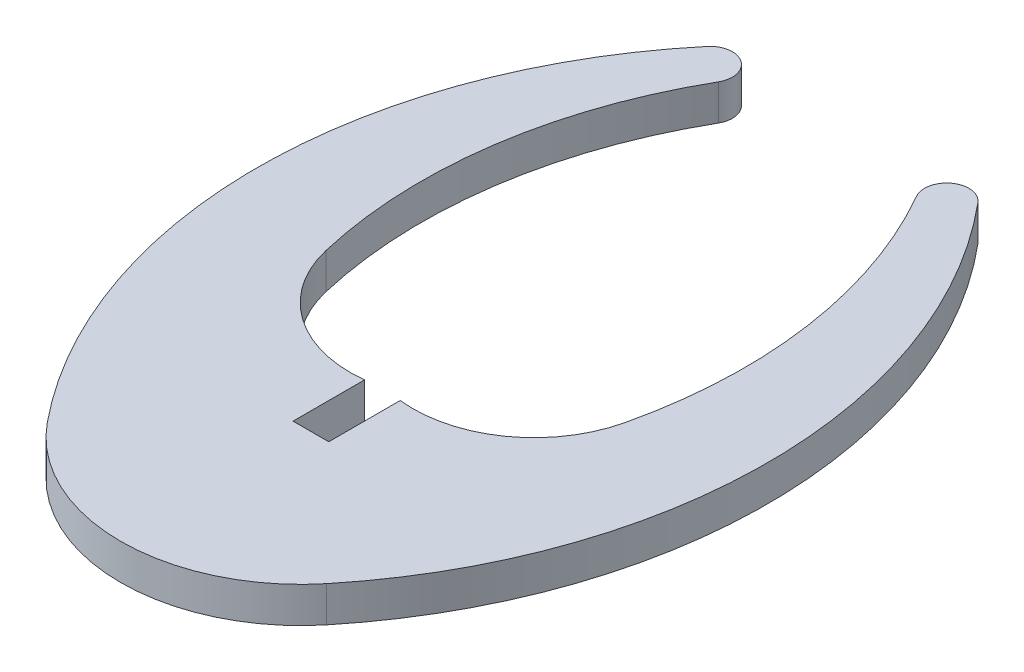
ISO-10303-21;
HEADER;
FILE_DESCRIPTION(('STEP AP214'),'2;1');
FILE_NAME('part.step','',(''),(''),'','','');
FILE_SCHEMA(('AUTOMOTIVE_DESIGN { 1 0 10303 214 1 1 1 1 }'));
ENDSEC;
DATA;
#1=APPLICATION_CONTEXT('core data for automotive mechanical design processes');
#2=APPLICATION_PROTOCOL_DEFINITION('international standard','automotive_design',2000,#1);
#3=PRODUCT_CONTEXT('',#1,'mechanical');
#4=PRODUCT('Part','Part','',(#3));
#5=PRODUCT_RELATED_PRODUCT_CATEGORY('part','',(#4));
#6=PRODUCT_DEFINITION_FORMATION('','',#4);
#7=PRODUCT_DEFINITION_CONTEXT('part definition',#1,'design');
#8=PRODUCT_DEFINITION('design','',#6,#7);
#9=PRODUCT_DEFINITION_SHAPE('','',#8);
#10=(LENGTH_UNIT() NAMED_UNIT(*) SI_UNIT(.MILLI.,.METRE.));
#11=(NAMED_UNIT(*) PLANE_ANGLE_UNIT() SI_UNIT($,.RADIAN.));
#12=(NAMED_UNIT(*) SI_UNIT($,.STERADIAN.) SOLID_ANGLE_UNIT());
#13=UNCERTAINTY_MEASURE_WITH_UNIT(LENGTH_MEASURE(1.E-05),#10,'distance_accuracy_value','');
#14=(GEOMETRIC_REPRESENTATION_CONTEXT(3) GLOBAL_UNCERTAINTY_ASSIGNED_CONTEXT((#13)) GLOBAL_UNIT_ASSIGNED_CONTEXT((#10,
#11,#12)) REPRESENTATION_CONTEXT('',''));
#15=CARTESIAN_POINT('',(0.,0.,0.));
#16=DIRECTION('',(0.,0.,1.));
#17=DIRECTION('',(1.,0.,0.));
#18=AXIS2_PLACEMENT_3D('',#15,#16,#17);
#19=CARTESIAN_POINT('',(-41982.755885,3.,-18425.403028));
#20=DIRECTION('',(-0.999999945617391,0.,0.000329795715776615));
#21=DIRECTION('',(0.000329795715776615,0.,0.999999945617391));
#22=AXIS2_PLACEMENT_3D('',#19,#20,#21);
#23=PLANE('',#22);
#24=DIRECTION('',(-0.000329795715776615,0.,-0.999999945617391));
#25=VECTOR('',#24,1.);
#26=CARTESIAN_POINT('',(-41982.755885,0.,-18425.403028));
#27=LINE('',#26,#25);
#28=CARTESIAN_POINT('',(-41982.753906,0.,-18419.402344));
#29=VERTEX_POINT('',#28);
#30=CARTESIAN_POINT('',(-41982.755885,0.,-18425.403028));
#31=VERTEX_POINT('',#30);
#32=EDGE_CURVE('E156',#29,#31,#27,.T.);
#33=ORIENTED_EDGE('',*,*,#32,.T.);
#34=DIRECTION('',(0.,-1.,0.));
#35=VECTOR('',#34,1.);
#36=CARTESIAN_POINT('',(-41982.755885,3.,-18425.403028));
#37=LINE('',#36,#35);
#38=CARTESIAN_POINT('',(-41982.755885,3.,-18425.403028));
#39=VERTEX_POINT('',#38);
#40=EDGE_CURVE('E11',#39,#31,#37,.T.);
#41=ORIENTED_EDGE('',*,*,#40,.F.);
#42=DIRECTION('',(-0.000329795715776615,0.,-0.999999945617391));
#43=VECTOR('',#42,1.);
#44=CARTESIAN_POINT('',(-41982.755885,3.,-18425.403028));
#45=LINE('',#44,#43);
#46=CARTESIAN_POINT('',(-41982.753906,3.,-18419.402344));
#47=VERTEX_POINT('',#46);
#48=EDGE_CURVE('E178',#47,#39,#45,.T.);
#49=ORIENTED_EDGE('',*,*,#48,.F.);
#50=DIRECTION('',(0.,-1.,0.));
#51=VECTOR('',#50,1.);
#52=CARTESIAN_POINT('',(-41982.753906,3.,-18419.402344));
#53=LINE('',#52,#51);
#54=EDGE_CURVE('E152',#47,#29,#53,.T.);
#55=ORIENTED_EDGE('',*,*,#54,.T.);
#56=EDGE_LOOP('',(#33,#41,#49,#55));
#57=FACE_BOUND('',#56,.T.);
#58=ADVANCED_FACE('F36',(#57),#23,.F.);
#59=CARTESIAN_POINT('',(-41983.8853105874,3.,-18435.5029115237));
#60=DIRECTION('',(0.,-1.,0.));
#61=DIRECTION('',(0.,0.,-1.));
#62=AXIS2_PLACEMENT_3D('',#59,#60,#61);
#63=CYLINDRICAL_SURFACE('',#62,10.1628366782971);
#64=CARTESIAN_POINT('',(-41983.8853105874,0.,-18435.5029115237));
#65=DIRECTION('',(0.,-1.,0.));
#66=DIRECTION('',(0.,0.,1.));
#67=AXIS2_PLACEMENT_3D('',#64,#65,#66);
#68=CIRCLE('',#67,10.1628366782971);
#69=CARTESIAN_POINT('',(-41993.780939,0.,-18433.18779));
#70=VERTEX_POINT('',#69);
#71=EDGE_CURVE('E159',#31,#70,#68,.T.);
#72=ORIENTED_EDGE('',*,*,#71,.T.);
#73=DIRECTION('',(0.,-1.,0.));
#74=VECTOR('',#73,1.);
#75=CARTESIAN_POINT('',(-41993.780939,3.,-18433.18779));
#76=LINE('',#75,#74);
#77=CARTESIAN_POINT('',(-41993.780939,3.,-18433.18779));
#78=VERTEX_POINT('',#77);
#79=EDGE_CURVE('E44',#78,#70,#76,.T.);
#80=ORIENTED_EDGE('',*,*,#79,.F.);
#81=CARTESIAN_POINT('',(-41983.8853105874,3.,-18435.5029115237));
#82=DIRECTION('',(0.,-1.,0.));
#83=DIRECTION('',(0.,0.,1.));
#84=AXIS2_PLACEMENT_3D('',#81,#82,#83);
#85=CIRCLE('',#84,10.1628366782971);
#86=EDGE_CURVE('E107',#39,#78,#85,.T.);
#87=ORIENTED_EDGE('',*,*,#86,.F.);
#88=ORIENTED_EDGE('',*,*,#40,.T.);
#89=EDGE_LOOP('',(#72,#80,#87,#88));
#90=FACE_BOUND('',#89,.T.);
#91=ADVANCED_FACE('F256',(#90),#63,.F.);
#92=CARTESIAN_POINT('',(-41955.2299410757,3.,-18442.2204008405));
#93=DIRECTION('',(0.,-1.,0.));
#94=DIRECTION('',(0.,0.,-1.));
#95=AXIS2_PLACEMENT_3D('',#92,#93,#94);
#96=CYLINDRICAL_SURFACE('',#95,39.5950438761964);
#97=CARTESIAN_POINT('',(-41955.2299410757,0.,-18442.2204008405));
#98=DIRECTION('',(0.,-1.,0.));
#99=DIRECTION('',(0.,0.,1.));
#100=AXIS2_PLACEMENT_3D('',#97,#98,#99);
#101=CIRCLE('',#100,39.5950438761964);
#102=CARTESIAN_POINT('',(-41989.570389,0.,-18461.930833));
#103=VERTEX_POINT('',#102);
#104=EDGE_CURVE('E161',#70,#103,#101,.T.);
#105=ORIENTED_EDGE('',*,*,#104,.T.);
#106=DIRECTION('',(0.,-1.,0.));
#107=VECTOR('',#106,1.);
#108=CARTESIAN_POINT('',(-41989.570389,3.,-18461.930833));
#109=LINE('',#108,#107);
#110=CARTESIAN_POINT('',(-41989.570389,3.,-18461.930833));
#111=VERTEX_POINT('',#110);
#112=EDGE_CURVE('E197',#111,#103,#109,.T.);
#113=ORIENTED_EDGE('',*,*,#112,.F.);
#114=CARTESIAN_POINT('',(-41955.2299410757,3.,-18442.2204008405));
#115=DIRECTION('',(0.,-1.,0.));
#116=DIRECTION('',(0.,0.,1.));
#117=AXIS2_PLACEMENT_3D('',#114,#115,#116);
#118=CIRCLE('',#117,39.5950438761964);
#119=EDGE_CURVE('E205',#78,#111,#118,.T.);
#120=ORIENTED_EDGE('',*,*,#119,.F.);
#121=ORIENTED_EDGE('',*,*,#79,.T.);
#122=EDGE_LOOP('',(#105,#113,#120,#121));
#123=FACE_BOUND('',#122,.T.);
#124=ADVANCED_FACE('F203',(#123),#96,.F.);
#125=CARTESIAN_POINT('',(-41991.1827796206,3.,-18462.8549007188));
#126=DIRECTION('',(0.,-1.,0.));
#127=DIRECTION('',(0.,0.,-1.));
#128=AXIS2_PLACEMENT_3D('',#125,#126,#127);
#129=CYLINDRICAL_SURFACE('',#128,1.8584145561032);
#130=CARTESIAN_POINT('',(-41991.1827796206,0.,-18462.8549007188));
#131=DIRECTION('',(0.,1.,0.));
#132=DIRECTION('',(0.,0.,1.));
#133=AXIS2_PLACEMENT_3D('',#130,#131,#132);
#134=CIRCLE('',#133,1.8584145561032);
#135=CARTESIAN_POINT('',(-41992.6064460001,0.,-18464.049421));
#136=VERTEX_POINT('',#135);
#137=EDGE_CURVE('E163',#103,#136,#134,.T.);
#138=ORIENTED_EDGE('',*,*,#137,.T.);
#139=DIRECTION('',(0.,-1.,0.));
#140=VECTOR('',#139,1.);
#141=CARTESIAN_POINT('',(-41992.6064460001,3.,-18464.049421));
#142=LINE('',#141,#140);
#143=CARTESIAN_POINT('',(-41992.6064460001,3.,-18464.049421));
#144=VERTEX_POINT('',#143);
#145=EDGE_CURVE('E194',#144,#136,#142,.T.);
#146=ORIENTED_EDGE('',*,*,#145,.F.);
#147=CARTESIAN_POINT('',(-41991.1827796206,3.,-18462.8549007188));
#148=DIRECTION('',(0.,1.,0.));
#149=DIRECTION('',(0.,0.,1.));
#150=AXIS2_PLACEMENT_3D('',#147,#148,#149);
#151=CIRCLE('',#150,1.8584145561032);
#152=EDGE_CURVE('E223',#111,#144,#151,.T.);
#153=ORIENTED_EDGE('',*,*,#152,.F.);
#154=ORIENTED_EDGE('',*,*,#112,.T.);
#155=EDGE_LOOP('',(#138,#146,#153,#154));
#156=FACE_BOUND('',#155,.T.);
#157=ADVANCED_FACE('F214',(#156),#129,.T.);
#158=CARTESIAN_POINT('',(-41959.4843939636,3.,-18436.2941148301));
#159=DIRECTION('',(0.,-1.,0.));
#160=DIRECTION('',(0.,0.,-1.));
#161=AXIS2_PLACEMENT_3D('',#158,#159,#160);
#162=CYLINDRICAL_SURFACE('',#161,43.2137403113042);
#163=CARTESIAN_POINT('',(-41959.4843939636,0.,-18436.2941148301));
#164=DIRECTION('',(0.,1.,0.));
#165=DIRECTION('',(0.,0.,1.));
#166=AXIS2_PLACEMENT_3D('',#163,#164,#165);
#167=CIRCLE('',#166,43.2137403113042);
#168=CARTESIAN_POINT('',(-41992.984684,0.,-18408.996534));
#169=VERTEX_POINT('',#168);
#170=EDGE_CURVE('E165',#136,#169,#167,.T.);
#171=ORIENTED_EDGE('',*,*,#170,.T.);
#172=DIRECTION('',(0.,-1.,0.));
#173=VECTOR('',#172,1.);
#174=CARTESIAN_POINT('',(-41992.984684,3.,-18408.996534));
#175=LINE('',#174,#173);
#176=CARTESIAN_POINT('',(-41992.984684,3.,-18408.996534));
#177=VERTEX_POINT('',#176);
#178=EDGE_CURVE('E191',#177,#169,#175,.T.);
#179=ORIENTED_EDGE('',*,*,#178,.F.);
#180=CARTESIAN_POINT('',(-41959.4843939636,3.,-18436.2941148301));
#181=DIRECTION('',(0.,1.,0.));
#182=DIRECTION('',(0.,0.,1.));
#183=AXIS2_PLACEMENT_3D('',#180,#181,#182);
#184=CIRCLE('',#183,43.2137403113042);
#185=EDGE_CURVE('E220',#144,#177,#184,.T.);
#186=ORIENTED_EDGE('',*,*,#185,.F.);
#187=ORIENTED_EDGE('',*,*,#145,.T.);
#188=EDGE_LOOP('',(#171,#179,#186,#187));
#189=FACE_BOUND('',#188,.T.);
#190=ADVANCED_FACE('F218',(#189),#162,.T.);
#191=CARTESIAN_POINT('',(-41981.2566091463,3.,-18418.5546868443));
#192=DIRECTION('',(0.,-1.,0.));
#193=DIRECTION('',(0.,0.,-1.));
#194=AXIS2_PLACEMENT_3D('',#191,#192,#193);
#195=CYLINDRICAL_SURFACE('',#194,15.1296406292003);
#196=CARTESIAN_POINT('',(-41981.2566091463,0.,-18418.5546868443));
#197=DIRECTION('',(0.,1.,0.));
#198=DIRECTION('',(0.,0.,1.));
#199=AXIS2_PLACEMENT_3D('',#196,#197,#198);
#200=CIRCLE('',#199,15.1296406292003);
#201=CARTESIAN_POINT('',(-41969.530626,0.,-18408.993968));
#202=VERTEX_POINT('',#201);
#203=EDGE_CURVE('E167',#169,#202,#200,.T.);
#204=ORIENTED_EDGE('',*,*,#203,.T.);
#205=DIRECTION('',(0.,-1.,0.));
#206=VECTOR('',#205,1.);
#207=CARTESIAN_POINT('',(-41969.530626,3.,-18408.993968));
#208=LINE('',#207,#206);
#209=CARTESIAN_POINT('',(-41969.530626,3.,-18408.993968));
#210=VERTEX_POINT('',#209);
#211=EDGE_CURVE('E188',#210,#202,#208,.T.);
#212=ORIENTED_EDGE('',*,*,#211,.F.);
#213=CARTESIAN_POINT('',(-41981.2566091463,3.,-18418.5546868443));
#214=DIRECTION('',(0.,1.,0.));
#215=DIRECTION('',(0.,0.,1.));
#216=AXIS2_PLACEMENT_3D('',#213,#214,#215);
#217=CIRCLE('',#216,15.1296406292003);
#218=EDGE_CURVE('E222',#177,#210,#217,.T.);
#219=ORIENTED_EDGE('',*,*,#218,.F.);
#220=ORIENTED_EDGE('',*,*,#178,.T.);
#221=EDGE_LOOP('',(#204,#212,#219,#220));
#222=FACE_BOUND('',#221,.T.);
#223=ADVANCED_FACE('F269',(#222),#195,.T.);
#224=CARTESIAN_POINT('',(-42003.0195178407,3.,-18436.3007296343));
#225=DIRECTION('',(0.,-1.,0.));
#226=DIRECTION('',(0.,0.,-1.));
#227=AXIS2_PLACEMENT_3D('',#224,#225,#226);
#228=CYLINDRICAL_SURFACE('',#227,43.2107059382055);
#229=CARTESIAN_POINT('',(-42003.0195178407,0.,-18436.3007296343));
#230=DIRECTION('',(0.,1.,0.));
#231=DIRECTION('',(0.,0.,1.));
#232=AXIS2_PLACEMENT_3D('',#229,#230,#231);
#233=CIRCLE('',#232,43.2107059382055);
#234=CARTESIAN_POINT('',(-41969.8920510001,0.,-18464.044847));
#235=VERTEX_POINT('',#234);
#236=EDGE_CURVE('E169',#202,#235,#233,.T.);
#237=ORIENTED_EDGE('',*,*,#236,.T.);
#238=DIRECTION('',(0.,-1.,0.));
#239=VECTOR('',#238,1.);
#240=CARTESIAN_POINT('',(-41969.8920510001,3.,-18464.044847));
#241=LINE('',#240,#239);
#242=CARTESIAN_POINT('',(-41969.8920510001,3.,-18464.044847));
#243=VERTEX_POINT('',#242);
#244=EDGE_CURVE('E185',#243,#235,#241,.T.);
#245=ORIENTED_EDGE('',*,*,#244,.F.);
#246=CARTESIAN_POINT('',(-42003.0195178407,3.,-18436.3007296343));
#247=DIRECTION('',(0.,1.,0.));
#248=DIRECTION('',(0.,0.,1.));
#249=AXIS2_PLACEMENT_3D('',#246,#247,#248);
#250=CIRCLE('',#249,43.2107059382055);
#251=EDGE_CURVE('E225',#210,#243,#250,.T.);
#252=ORIENTED_EDGE('',*,*,#251,.F.);
#253=ORIENTED_EDGE('',*,*,#211,.T.);
#254=EDGE_LOOP('',(#237,#245,#252,#253));
#255=FACE_BOUND('',#254,.T.);
#256=ADVANCED_FACE('F272',(#255),#228,.T.);
#257=CARTESIAN_POINT('',(-41971.3161001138,3.,-18462.8498222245));
#258=DIRECTION('',(0.,-1.,0.));
#259=DIRECTION('',(0.,0.,-1.));
#260=AXIS2_PLACEMENT_3D('',#257,#258,#259);
#261=CYLINDRICAL_SURFACE('',#260,1.85903203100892);
#262=CARTESIAN_POINT('',(-41971.3161001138,0.,-18462.8498222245));
#263=DIRECTION('',(0.,1.,0.));
#264=DIRECTION('',(0.,0.,1.));
#265=AXIS2_PLACEMENT_3D('',#262,#263,#264);
#266=CIRCLE('',#265,1.85903203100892);
#267=CARTESIAN_POINT('',(-41972.930009,0.,-18461.9271639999));
#268=VERTEX_POINT('',#267);
#269=EDGE_CURVE('E171',#235,#268,#266,.T.);
#270=ORIENTED_EDGE('',*,*,#269,.T.);
#271=DIRECTION('',(0.,-1.,0.));
#272=VECTOR('',#271,1.);
#273=CARTESIAN_POINT('',(-41972.930009,3.,-18461.9271639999));
#274=LINE('',#273,#272);
#275=CARTESIAN_POINT('',(-41972.930009,3.,-18461.9271639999));
#276=VERTEX_POINT('',#275);
#277=EDGE_CURVE('E182',#276,#268,#274,.T.);
#278=ORIENTED_EDGE('',*,*,#277,.F.);
#279=CARTESIAN_POINT('',(-41971.3161001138,3.,-18462.8498222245));
#280=DIRECTION('',(0.,1.,0.));
#281=DIRECTION('',(0.,0.,1.));
#282=AXIS2_PLACEMENT_3D('',#279,#280,#281);
#283=CIRCLE('',#282,1.85903203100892);
#284=EDGE_CURVE('E231',#243,#276,#283,.T.);
#285=ORIENTED_EDGE('',*,*,#284,.F.);
#286=ORIENTED_EDGE('',*,*,#244,.T.);
#287=EDGE_LOOP('',(#270,#278,#285,#286));
#288=FACE_BOUND('',#287,.T.);
#289=ADVANCED_FACE('F237',(#288),#261,.T.);
#290=CARTESIAN_POINT('',(-42007.2733840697,3.,-18442.2242472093));
#291=DIRECTION('',(0.,-1.,0.));
#292=DIRECTION('',(0.,0.,-1.));
#293=AXIS2_PLACEMENT_3D('',#290,#291,#292);
#294=CYLINDRICAL_SURFACE('',#293,39.5938422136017);
#295=CARTESIAN_POINT('',(-42007.2733840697,0.,-18442.2242472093));
#296=DIRECTION('',(0.,-1.,0.));
#297=DIRECTION('',(0.,0.,1.));
#298=AXIS2_PLACEMENT_3D('',#295,#296,#297);
#299=CIRCLE('',#298,39.5938422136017);
#300=CARTESIAN_POINT('',(-41968.725069,0.,-18433.185456));
#301=VERTEX_POINT('',#300);
#302=EDGE_CURVE('E173',#268,#301,#299,.T.);
#303=ORIENTED_EDGE('',*,*,#302,.T.);
#304=DIRECTION('',(0.,-1.,0.));
#305=VECTOR('',#304,1.);
#306=CARTESIAN_POINT('',(-41968.725069,3.,-18433.185456));
#307=LINE('',#306,#305);
#308=CARTESIAN_POINT('',(-41968.725069,3.,-18433.185456));
#309=VERTEX_POINT('',#308);
#310=EDGE_CURVE('E147',#309,#301,#307,.T.);
#311=ORIENTED_EDGE('',*,*,#310,.F.);
#312=CARTESIAN_POINT('',(-42007.2733840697,3.,-18442.2242472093));
#313=DIRECTION('',(0.,-1.,0.));
#314=DIRECTION('',(0.,0.,1.));
#315=AXIS2_PLACEMENT_3D('',#312,#313,#314);
#316=CIRCLE('',#315,39.5938422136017);
#317=EDGE_CURVE('E138',#276,#309,#316,.T.);
#318=ORIENTED_EDGE('',*,*,#317,.F.);
#319=ORIENTED_EDGE('',*,*,#277,.T.);
#320=EDGE_LOOP('',(#303,#311,#318,#319));
#321=FACE_BOUND('',#320,.T.);
#322=ADVANCED_FACE('F241',(#321),#294,.F.);
#323=CARTESIAN_POINT('',(-41978.6219159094,3.,-18435.5033261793));
#324=DIRECTION('',(0.,-1.,0.));
#325=DIRECTION('',(0.,0.,-1.));
#326=AXIS2_PLACEMENT_3D('',#323,#324,#325);
#327=CYLINDRICAL_SURFACE('',#326,10.1646495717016);
#328=CARTESIAN_POINT('',(-41978.6219159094,0.,-18435.5033261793));
#329=DIRECTION('',(0.,-1.,0.));
#330=DIRECTION('',(0.,0.,1.));
#331=AXIS2_PLACEMENT_3D('',#328,#329,#330);
#332=CIRCLE('',#331,10.1646495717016);
#333=CARTESIAN_POINT('',(-41979.757812,0.,-18425.402344));
#334=VERTEX_POINT('',#333);
#335=EDGE_CURVE('E146',#301,#334,#332,.T.);
#336=ORIENTED_EDGE('',*,*,#335,.T.);
#337=DIRECTION('',(0.,-1.,0.));
#338=VECTOR('',#337,1.);
#339=CARTESIAN_POINT('',(-41979.757812,3.,-18425.402344));
#340=LINE('',#339,#338);
#341=CARTESIAN_POINT('',(-41979.757812,3.,-18425.402344));
#342=VERTEX_POINT('',#341);
#343=EDGE_CURVE('E143',#342,#334,#340,.T.);
#344=ORIENTED_EDGE('',*,*,#343,.F.);
#345=CARTESIAN_POINT('',(-41978.6219159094,3.,-18435.5033261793));
#346=DIRECTION('',(0.,-1.,0.));
#347=DIRECTION('',(0.,0.,1.));
#348=AXIS2_PLACEMENT_3D('',#345,#346,#347);
#349=CIRCLE('',#348,10.1646495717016);
#350=EDGE_CURVE('E132',#309,#342,#349,.T.);
#351=ORIENTED_EDGE('',*,*,#350,.F.);
#352=ORIENTED_EDGE('',*,*,#310,.T.);
#353=EDGE_LOOP('',(#336,#344,#351,#352));
#354=FACE_BOUND('',#353,.T.);
#355=ADVANCED_FACE('F144',(#354),#327,.F.);
#356=CARTESIAN_POINT('',(-41979.757812,3.,-18419.402344));
#357=DIRECTION('',(1.,0.,0.));
#358=DIRECTION('',(0.,0.,-1.));
#359=AXIS2_PLACEMENT_3D('',#356,#357,#358);
#360=PLANE('',#359);
#361=DIRECTION('',(0.,0.,1.));
#362=VECTOR('',#361,1.);
#363=CARTESIAN_POINT('',(-41979.757812,0.,-18419.402344));
#364=LINE('',#363,#362);
#365=CARTESIAN_POINT('',(-41979.757812,0.,-18419.402344));
#366=VERTEX_POINT('',#365);
#367=EDGE_CURVE('E93',#334,#366,#364,.T.);
#368=ORIENTED_EDGE('',*,*,#367,.T.);
#369=DIRECTION('',(0.,-1.,0.));
#370=VECTOR('',#369,1.);
#371=CARTESIAN_POINT('',(-41979.757812,3.,-18419.402344));
#372=LINE('',#371,#370);
#373=CARTESIAN_POINT('',(-41979.757812,3.,-18419.402344));
#374=VERTEX_POINT('',#373);
#375=EDGE_CURVE('E148',#374,#366,#372,.T.);
#376=ORIENTED_EDGE('',*,*,#375,.F.);
#377=DIRECTION('',(0.,0.,1.));
#378=VECTOR('',#377,1.);
#379=CARTESIAN_POINT('',(-41979.757812,3.,-18419.402344));
#380=LINE('',#379,#378);
#381=EDGE_CURVE('E136',#342,#374,#380,.T.);
#382=ORIENTED_EDGE('',*,*,#381,.F.);
#383=ORIENTED_EDGE('',*,*,#343,.T.);
#384=EDGE_LOOP('',(#368,#376,#382,#383));
#385=FACE_BOUND('',#384,.T.);
#386=ADVANCED_FACE('F150',(#385),#360,.F.);
#387=CARTESIAN_POINT('',(-41982.753906,3.,-18419.402344));
#388=DIRECTION('',(0.,0.,1.));
#389=DIRECTION('',(1.,0.,0.));
#390=AXIS2_PLACEMENT_3D('',#387,#388,#389);
#391=PLANE('',#390);
#392=DIRECTION('',(-1.,0.,0.));
#393=VECTOR('',#392,1.);
#394=CARTESIAN_POINT('',(-41982.753906,0.,-18419.402344));
#395=LINE('',#394,#393);
#396=EDGE_CURVE('E99',#366,#29,#395,.T.);
#397=ORIENTED_EDGE('',*,*,#396,.T.);
#398=ORIENTED_EDGE('',*,*,#54,.F.);
#399=DIRECTION('',(-1.,0.,0.));
#400=VECTOR('',#399,1.);
#401=CARTESIAN_POINT('',(-41982.753906,3.,-18419.402344));
#402=LINE('',#401,#400);
#403=EDGE_CURVE('E52',#374,#47,#402,.T.);
#404=ORIENTED_EDGE('',*,*,#403,.F.);
#405=ORIENTED_EDGE('',*,*,#375,.T.);
#406=EDGE_LOOP('',(#397,#398,#404,#405));
#407=FACE_BOUND('',#406,.T.);
#408=ADVANCED_FACE('F245',(#407),#391,.F.);
#409=CARTESIAN_POINT('',(-41978.6219159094,3.,-18435.5033261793));
#410=DIRECTION('',(0.,1.,0.));
#411=DIRECTION('',(0.,0.,1.));
#412=AXIS2_PLACEMENT_3D('',#409,#410,#411);
#413=PLANE('',#412);
#414=ORIENTED_EDGE('',*,*,#48,.T.);
#415=ORIENTED_EDGE('',*,*,#86,.T.);
#416=ORIENTED_EDGE('',*,*,#119,.T.);
#417=ORIENTED_EDGE('',*,*,#152,.T.);
#418=ORIENTED_EDGE('',*,*,#185,.T.);
#419=ORIENTED_EDGE('',*,*,#218,.T.);
#420=ORIENTED_EDGE('',*,*,#251,.T.);
#421=ORIENTED_EDGE('',*,*,#284,.T.);
#422=ORIENTED_EDGE('',*,*,#317,.T.);
#423=ORIENTED_EDGE('',*,*,#350,.T.);
#424=ORIENTED_EDGE('',*,*,#381,.T.);
#425=ORIENTED_EDGE('',*,*,#403,.T.);
#426=EDGE_LOOP('',(#414,#415,#416,#417,#418,#419,#420,#421,#422,#423,#424,#425));
#427=FACE_BOUND('',#426,.T.);
#428=ADVANCED_FACE('F134',(#427),#413,.T.);
#429=CARTESIAN_POINT('',(-41978.6219159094,0.,-18435.5033261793));
#430=DIRECTION('',(0.,1.,0.));
#431=DIRECTION('',(0.,0.,1.));
#432=AXIS2_PLACEMENT_3D('',#429,#430,#431);
#433=PLANE('',#432);
#434=ORIENTED_EDGE('',*,*,#32,.F.);
#435=ORIENTED_EDGE('',*,*,#396,.F.);
#436=ORIENTED_EDGE('',*,*,#367,.F.);
#437=ORIENTED_EDGE('',*,*,#335,.F.);
#438=ORIENTED_EDGE('',*,*,#302,.F.);
#439=ORIENTED_EDGE('',*,*,#269,.F.);
#440=ORIENTED_EDGE('',*,*,#236,.F.);
#441=ORIENTED_EDGE('',*,*,#203,.F.);
#442=ORIENTED_EDGE('',*,*,#170,.F.);
#443=ORIENTED_EDGE('',*,*,#137,.F.);
#444=ORIENTED_EDGE('',*,*,#104,.F.);
#445=ORIENTED_EDGE('',*,*,#71,.F.);
#446=EDGE_LOOP('',(#434,#435,#436,#437,#438,#439,#440,#441,#442,#443,#444,#445));
#447=FACE_BOUND('',#446,.T.);
#448=ADVANCED_FACE('F209',(#447),#433,.F.);
#449=CLOSED_SHELL('',(#58,#91,#124,#157,#190,#223,#256,#289,#322,#355,#386,#408,#428,#448));
#450=MANIFOLD_SOLID_BREP('B2',#449);
#451=ADVANCED_BREP_SHAPE_REPRESENTATION('',(#18,#450),#14);
#452=SHAPE_DEFINITION_REPRESENTATION(#9,#451);
ENDSEC;
END-ISO-10303-21;
